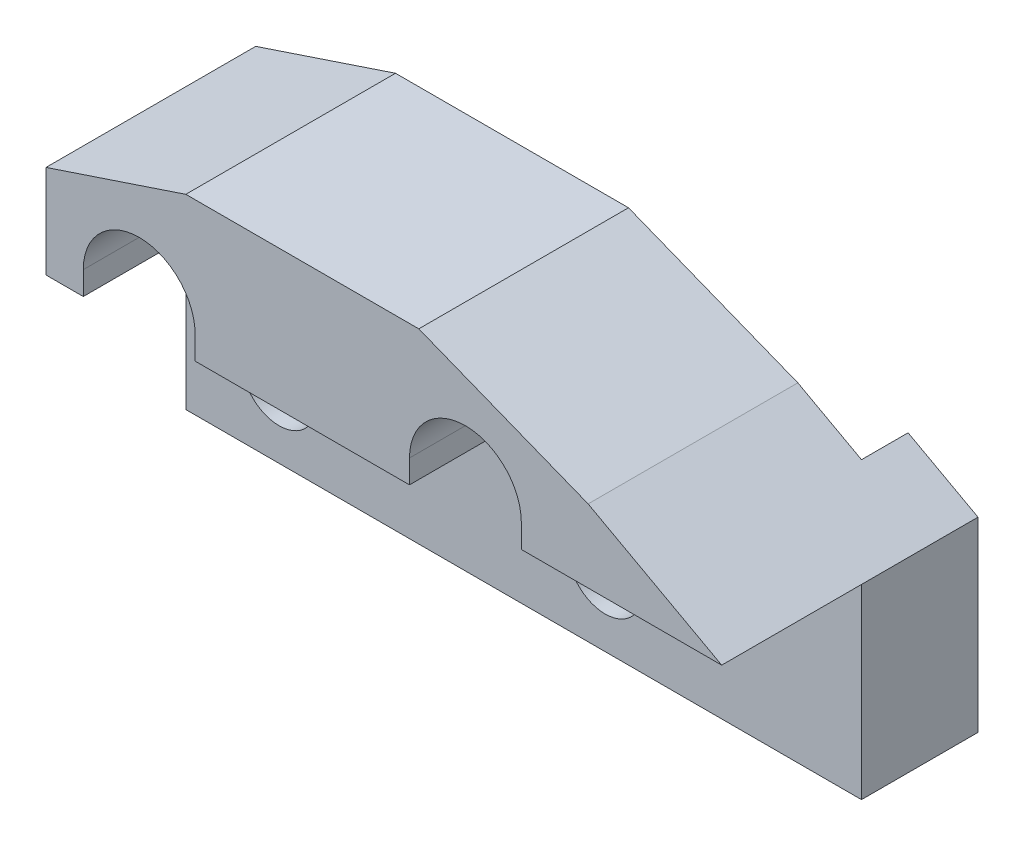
ISO-10303-21;
HEADER;
FILE_DESCRIPTION(('STEP AP214'),'2;1');
FILE_NAME('part.step','',(''),(''),'','','');
FILE_SCHEMA(('AUTOMOTIVE_DESIGN { 1 0 10303 214 1 1 1 1 }'));
ENDSEC;
DATA;
#1=APPLICATION_CONTEXT('core data for automotive mechanical design processes');
#2=APPLICATION_PROTOCOL_DEFINITION('international standard','automotive_design',2000,#1);
#3=PRODUCT_CONTEXT('',#1,'mechanical');
#4=PRODUCT('Part','Part','',(#3));
#5=PRODUCT_RELATED_PRODUCT_CATEGORY('part','',(#4));
#6=PRODUCT_DEFINITION_FORMATION('','',#4);
#7=PRODUCT_DEFINITION_CONTEXT('part definition',#1,'design');
#8=PRODUCT_DEFINITION('design','',#6,#7);
#9=PRODUCT_DEFINITION_SHAPE('','',#8);
#10=(LENGTH_UNIT() NAMED_UNIT(*) SI_UNIT(.MILLI.,.METRE.));
#11=(NAMED_UNIT(*) PLANE_ANGLE_UNIT() SI_UNIT($,.RADIAN.));
#12=(NAMED_UNIT(*) SI_UNIT($,.STERADIAN.) SOLID_ANGLE_UNIT());
#13=UNCERTAINTY_MEASURE_WITH_UNIT(LENGTH_MEASURE(1.E-05),#10,'distance_accuracy_value','');
#14=(GEOMETRIC_REPRESENTATION_CONTEXT(3) GLOBAL_UNCERTAINTY_ASSIGNED_CONTEXT((#13)) GLOBAL_UNIT_ASSIGNED_CONTEXT((#10,
#11,#12)) REPRESENTATION_CONTEXT('',''));
#15=CARTESIAN_POINT('',(0.,0.,0.));
#16=DIRECTION('',(0.,0.,1.));
#17=DIRECTION('',(1.,0.,0.));
#18=AXIS2_PLACEMENT_3D('',#15,#16,#17);
#19=CARTESIAN_POINT('',(107.732096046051,-10.039789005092,45.));
#20=DIRECTION('',(0.,1.,0.));
#21=DIRECTION('',(0.,0.,1.));
#22=AXIS2_PLACEMENT_3D('',#19,#20,#21);
#23=PLANE('',#22);
#24=DIRECTION('',(1.,0.,0.));
#25=VECTOR('',#24,1.);
#26=CARTESIAN_POINT('',(35.2320960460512,-10.039789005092,45.));
#27=LINE('',#26,#25);
#28=CARTESIAN_POINT('',(-5.26790395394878,-10.039789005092,45.));
#29=VERTEX_POINT('',#28);
#30=CARTESIAN_POINT('',(40.7320960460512,-10.039789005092,45.));
#31=VERTEX_POINT('',#30);
#32=EDGE_CURVE('E160',#29,#31,#27,.T.);
#33=ORIENTED_EDGE('',*,*,#32,.F.);
#34=DIRECTION('',(0.,0.,-1.));
#35=VECTOR('',#34,1.);
#36=CARTESIAN_POINT('',(-5.26790395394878,-10.039789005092,15.));
#37=LINE('',#36,#35);
#38=CARTESIAN_POINT('',(-5.26790395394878,-10.039789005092,15.));
#39=VERTEX_POINT('',#38);
#40=EDGE_CURVE('E159',#29,#39,#37,.T.);
#41=ORIENTED_EDGE('',*,*,#40,.T.);
#42=DIRECTION('',(1.,0.,0.));
#43=VECTOR('',#42,1.);
#44=CARTESIAN_POINT('',(35.2320960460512,-10.039789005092,15.));
#45=LINE('',#44,#43);
#46=CARTESIAN_POINT('',(40.7320960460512,-10.039789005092,15.));
#47=VERTEX_POINT('',#46);
#48=EDGE_CURVE('E145',#47,#39,#45,.F.);
#49=ORIENTED_EDGE('',*,*,#48,.F.);
#50=DIRECTION('',(0.,0.,1.));
#51=VECTOR('',#50,1.);
#52=CARTESIAN_POINT('',(40.7320960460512,-10.039789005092,15.));
#53=LINE('',#52,#51);
#54=EDGE_CURVE('E309',#47,#31,#53,.T.);
#55=ORIENTED_EDGE('',*,*,#54,.T.);
#56=EDGE_LOOP('',(#33,#41,#49,#55));
#57=FACE_BOUND('',#56,.T.);
#58=ADVANCED_FACE('F16',(#57),#23,.F.);
#59=CARTESIAN_POINT('',(-5.26790395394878,-5.03978900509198,15.));
#60=DIRECTION('',(1.,0.,0.));
#61=DIRECTION('',(0.,0.,-1.));
#62=AXIS2_PLACEMENT_3D('',#59,#60,#61);
#63=PLANE('',#62);
#64=DIRECTION('',(0.,1.,0.));
#65=VECTOR('',#64,1.);
#66=CARTESIAN_POINT('',(-5.26790395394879,-15.039789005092,45.));
#67=LINE('',#66,#65);
#68=CARTESIAN_POINT('',(-5.26790395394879,-5.03978900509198,45.));
#69=VERTEX_POINT('',#68);
#70=EDGE_CURVE('E366',#69,#29,#67,.F.);
#71=ORIENTED_EDGE('',*,*,#70,.F.);
#72=DIRECTION('',(0.,0.,1.));
#73=VECTOR('',#72,1.);
#74=CARTESIAN_POINT('',(-5.26790395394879,-5.03978900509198,15.));
#75=LINE('',#74,#73);
#76=CARTESIAN_POINT('',(-5.26790395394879,-5.03978900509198,15.));
#77=VERTEX_POINT('',#76);
#78=EDGE_CURVE('E164',#69,#77,#75,.F.);
#79=ORIENTED_EDGE('',*,*,#78,.T.);
#80=DIRECTION('',(0.,1.,0.));
#81=VECTOR('',#80,1.);
#82=CARTESIAN_POINT('',(-5.26790395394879,-30.039789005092,15.));
#83=LINE('',#82,#81);
#84=EDGE_CURVE('E149',#39,#77,#83,.T.);
#85=ORIENTED_EDGE('',*,*,#84,.F.);
#86=ORIENTED_EDGE('',*,*,#40,.F.);
#87=EDGE_LOOP('',(#71,#79,#85,#86));
#88=FACE_BOUND('',#87,.T.);
#89=ADVANCED_FACE('F166',(#88),#63,.F.);
#90=CARTESIAN_POINT('',(-17.2679039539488,-5.03978900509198,15.));
#91=DIRECTION('',(0.,0.,1.));
#92=DIRECTION('',(1.,0.,0.));
#93=AXIS2_PLACEMENT_3D('',#90,#91,#92);
#94=CYLINDRICAL_SURFACE('',#93,12.);
#95=DIRECTION('',(0.,0.,1.));
#96=VECTOR('',#95,1.);
#97=CARTESIAN_POINT('',(-29.2679039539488,-5.03978900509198,15.));
#98=LINE('',#97,#96);
#99=CARTESIAN_POINT('',(-29.2679039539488,-5.03978900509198,45.));
#100=VERTEX_POINT('',#99);
#101=CARTESIAN_POINT('',(-29.2679039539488,-5.03978900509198,15.));
#102=VERTEX_POINT('',#101);
#103=EDGE_CURVE('E119',#100,#102,#98,.F.);
#104=ORIENTED_EDGE('',*,*,#103,.T.);
#105=CARTESIAN_POINT('',(-17.2679039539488,-5.03978900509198,15.));
#106=DIRECTION('',(0.,0.,1.));
#107=DIRECTION('',(1.,0.,0.));
#108=AXIS2_PLACEMENT_3D('',#105,#106,#107);
#109=CIRCLE('',#108,12.);
#110=EDGE_CURVE('E168',#77,#102,#109,.T.);
#111=ORIENTED_EDGE('',*,*,#110,.F.);
#112=ORIENTED_EDGE('',*,*,#78,.F.);
#113=CARTESIAN_POINT('',(-17.2679039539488,-5.03978900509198,45.));
#114=DIRECTION('',(0.,0.,1.));
#115=DIRECTION('',(1.,0.,0.));
#116=AXIS2_PLACEMENT_3D('',#113,#114,#115);
#117=CIRCLE('',#116,12.);
#118=EDGE_CURVE('E401',#100,#69,#117,.F.);
#119=ORIENTED_EDGE('',*,*,#118,.F.);
#120=EDGE_LOOP('',(#104,#111,#112,#119));
#121=FACE_BOUND('',#120,.T.);
#122=ADVANCED_FACE('F538',(#121),#94,.F.);
#123=CARTESIAN_POINT('',(-29.2679039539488,-19.6457828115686,15.));
#124=DIRECTION('',(-1.,0.,0.));
#125=DIRECTION('',(0.,0.,1.));
#126=AXIS2_PLACEMENT_3D('',#123,#124,#125);
#127=PLANE('',#126);
#128=DIRECTION('',(0.,1.,0.));
#129=VECTOR('',#128,1.);
#130=CARTESIAN_POINT('',(-29.2679039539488,-30.039789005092,15.));
#131=LINE('',#130,#129);
#132=CARTESIAN_POINT('',(-29.2679039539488,-10.039789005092,15.));
#133=VERTEX_POINT('',#132);
#134=EDGE_CURVE('E170',#102,#133,#131,.F.);
#135=ORIENTED_EDGE('',*,*,#134,.F.);
#136=ORIENTED_EDGE('',*,*,#103,.F.);
#137=DIRECTION('',(0.,1.,0.));
#138=VECTOR('',#137,1.);
#139=CARTESIAN_POINT('',(-29.2679039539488,-15.039789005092,45.));
#140=LINE('',#139,#138);
#141=CARTESIAN_POINT('',(-29.2679039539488,-10.039789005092,45.));
#142=VERTEX_POINT('',#141);
#143=EDGE_CURVE('E371',#142,#100,#140,.T.);
#144=ORIENTED_EDGE('',*,*,#143,.F.);
#145=DIRECTION('',(0.,0.,1.));
#146=VECTOR('',#145,1.);
#147=CARTESIAN_POINT('',(-29.2679039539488,-10.039789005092,45.));
#148=LINE('',#147,#146);
#149=EDGE_CURVE('E128',#142,#133,#148,.F.);
#150=ORIENTED_EDGE('',*,*,#149,.T.);
#151=EDGE_LOOP('',(#135,#136,#144,#150));
#152=FACE_BOUND('',#151,.T.);
#153=ADVANCED_FACE('F533',(#152),#127,.F.);
#154=CARTESIAN_POINT('',(64.7320960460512,-5.03978900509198,15.));
#155=DIRECTION('',(1.,0.,0.));
#156=DIRECTION('',(0.,0.,-1.));
#157=AXIS2_PLACEMENT_3D('',#154,#155,#156);
#158=PLANE('',#157);
#159=DIRECTION('',(0.,1.,0.));
#160=VECTOR('',#159,1.);
#161=CARTESIAN_POINT('',(64.7320960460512,-15.039789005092,45.));
#162=LINE('',#161,#160);
#163=CARTESIAN_POINT('',(64.7320960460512,-5.03978900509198,45.));
#164=VERTEX_POINT('',#163);
#165=CARTESIAN_POINT('',(64.7320960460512,-10.039789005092,45.));
#166=VERTEX_POINT('',#165);
#167=EDGE_CURVE('E354',#164,#166,#162,.F.);
#168=ORIENTED_EDGE('',*,*,#167,.F.);
#169=DIRECTION('',(0.,0.,1.));
#170=VECTOR('',#169,1.);
#171=CARTESIAN_POINT('',(64.7320960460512,-5.03978900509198,15.));
#172=LINE('',#171,#170);
#173=CARTESIAN_POINT('',(64.7320960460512,-5.03978900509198,15.));
#174=VERTEX_POINT('',#173);
#175=EDGE_CURVE('E310',#164,#174,#172,.F.);
#176=ORIENTED_EDGE('',*,*,#175,.T.);
#177=DIRECTION('',(0.,1.,0.));
#178=VECTOR('',#177,1.);
#179=CARTESIAN_POINT('',(64.7320960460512,-30.039789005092,15.));
#180=LINE('',#179,#178);
#181=CARTESIAN_POINT('',(64.7320960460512,-10.039789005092,15.));
#182=VERTEX_POINT('',#181);
#183=EDGE_CURVE('E322',#182,#174,#180,.T.);
#184=ORIENTED_EDGE('',*,*,#183,.F.);
#185=DIRECTION('',(0.,0.,1.));
#186=VECTOR('',#185,1.);
#187=CARTESIAN_POINT('',(64.7320960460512,-10.039789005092,45.));
#188=LINE('',#187,#186);
#189=EDGE_CURVE('E312',#182,#166,#188,.T.);
#190=ORIENTED_EDGE('',*,*,#189,.T.);
#191=EDGE_LOOP('',(#168,#176,#184,#190));
#192=FACE_BOUND('',#191,.T.);
#193=ADVANCED_FACE('F528',(#192),#158,.F.);
#194=CARTESIAN_POINT('',(52.7320960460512,-5.03978900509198,15.));
#195=DIRECTION('',(0.,0.,1.));
#196=DIRECTION('',(1.,0.,0.));
#197=AXIS2_PLACEMENT_3D('',#194,#195,#196);
#198=CYLINDRICAL_SURFACE('',#197,12.);
#199=DIRECTION('',(0.,0.,1.));
#200=VECTOR('',#199,1.);
#201=CARTESIAN_POINT('',(40.7320960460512,-5.03978900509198,15.));
#202=LINE('',#201,#200);
#203=CARTESIAN_POINT('',(40.7320960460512,-5.03978900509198,45.));
#204=VERTEX_POINT('',#203);
#205=CARTESIAN_POINT('',(40.7320960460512,-5.03978900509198,15.));
#206=VERTEX_POINT('',#205);
#207=EDGE_CURVE('E306',#204,#206,#202,.F.);
#208=ORIENTED_EDGE('',*,*,#207,.T.);
#209=CARTESIAN_POINT('',(52.7320960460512,-5.03978900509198,15.));
#210=DIRECTION('',(0.,0.,1.));
#211=DIRECTION('',(1.,0.,0.));
#212=AXIS2_PLACEMENT_3D('',#209,#210,#211);
#213=CIRCLE('',#212,12.);
#214=EDGE_CURVE('E396',#174,#206,#213,.T.);
#215=ORIENTED_EDGE('',*,*,#214,.F.);
#216=ORIENTED_EDGE('',*,*,#175,.F.);
#217=CARTESIAN_POINT('',(52.7320960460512,-5.03978900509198,45.));
#218=DIRECTION('',(0.,0.,1.));
#219=DIRECTION('',(1.,0.,0.));
#220=AXIS2_PLACEMENT_3D('',#217,#218,#219);
#221=CIRCLE('',#220,12.);
#222=EDGE_CURVE('E398',#204,#164,#221,.F.);
#223=ORIENTED_EDGE('',*,*,#222,.F.);
#224=EDGE_LOOP('',(#208,#215,#216,#223));
#225=FACE_BOUND('',#224,.T.);
#226=ADVANCED_FACE('F523',(#225),#198,.F.);
#227=CARTESIAN_POINT('',(40.7320960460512,-19.4306242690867,15.));
#228=DIRECTION('',(-1.,0.,0.));
#229=DIRECTION('',(0.,0.,1.));
#230=AXIS2_PLACEMENT_3D('',#227,#228,#229);
#231=PLANE('',#230);
#232=DIRECTION('',(0.,1.,0.));
#233=VECTOR('',#232,1.);
#234=CARTESIAN_POINT('',(40.7320960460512,-30.039789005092,15.));
#235=LINE('',#234,#233);
#236=EDGE_CURVE('E152',#206,#47,#235,.F.);
#237=ORIENTED_EDGE('',*,*,#236,.F.);
#238=ORIENTED_EDGE('',*,*,#207,.F.);
#239=DIRECTION('',(0.,1.,0.));
#240=VECTOR('',#239,1.);
#241=CARTESIAN_POINT('',(40.7320960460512,-15.039789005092,45.));
#242=LINE('',#241,#240);
#243=EDGE_CURVE('E365',#31,#204,#242,.T.);
#244=ORIENTED_EDGE('',*,*,#243,.F.);
#245=ORIENTED_EDGE('',*,*,#54,.F.);
#246=EDGE_LOOP('',(#237,#238,#244,#245));
#247=FACE_BOUND('',#246,.T.);
#248=ADVANCED_FACE('F518',(#247),#231,.F.);
#249=CARTESIAN_POINT('',(107.732096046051,-10.039789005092,45.));
#250=DIRECTION('',(0.,1.,0.));
#251=DIRECTION('',(0.,0.,1.));
#252=AXIS2_PLACEMENT_3D('',#249,#250,#251);
#253=PLANE('',#252);
#254=DIRECTION('',(1.,0.,0.));
#255=VECTOR('',#254,1.);
#256=CARTESIAN_POINT('',(35.2320960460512,-10.039789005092,15.));
#257=LINE('',#256,#255);
#258=CARTESIAN_POINT('',(107.732096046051,-10.039789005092,15.));
#259=VERTEX_POINT('',#258);
#260=EDGE_CURVE('E319',#259,#182,#257,.F.);
#261=ORIENTED_EDGE('',*,*,#260,.F.);
#262=DIRECTION('',(0.,0.,1.));
#263=VECTOR('',#262,1.);
#264=CARTESIAN_POINT('',(107.732096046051,-10.039789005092,0.));
#265=LINE('',#264,#263);
#266=CARTESIAN_POINT('',(107.732096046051,-10.039789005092,45.));
#267=VERTEX_POINT('',#266);
#268=EDGE_CURVE('E186',#267,#259,#265,.F.);
#269=ORIENTED_EDGE('',*,*,#268,.F.);
#270=DIRECTION('',(1.,0.,0.));
#271=VECTOR('',#270,1.);
#272=CARTESIAN_POINT('',(35.2320960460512,-10.039789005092,45.));
#273=LINE('',#272,#271);
#274=EDGE_CURVE('E372',#166,#267,#273,.T.);
#275=ORIENTED_EDGE('',*,*,#274,.F.);
#276=ORIENTED_EDGE('',*,*,#189,.F.);
#277=EDGE_LOOP('',(#261,#269,#275,#276));
#278=FACE_BOUND('',#277,.T.);
#279=ADVANCED_FACE('F514',(#278),#253,.F.);
#280=CARTESIAN_POINT('',(107.732096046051,-10.039789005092,45.));
#281=DIRECTION('',(0.,1.,0.));
#282=DIRECTION('',(0.,0.,1.));
#283=AXIS2_PLACEMENT_3D('',#280,#281,#282);
#284=PLANE('',#283);
#285=DIRECTION('',(1.,0.,0.));
#286=VECTOR('',#285,1.);
#287=CARTESIAN_POINT('',(35.2320960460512,-10.039789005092,45.));
#288=LINE('',#287,#286);
#289=CARTESIAN_POINT('',(-37.2679039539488,-10.039789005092,45.));
#290=VERTEX_POINT('',#289);
#291=EDGE_CURVE('E369',#290,#142,#288,.T.);
#292=ORIENTED_EDGE('',*,*,#291,.F.);
#293=DIRECTION('',(0.,0.,1.));
#294=VECTOR('',#293,1.);
#295=CARTESIAN_POINT('',(-37.2679039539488,-10.039789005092,0.));
#296=LINE('',#295,#294);
#297=CARTESIAN_POINT('',(-37.2679039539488,-10.039789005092,15.));
#298=VERTEX_POINT('',#297);
#299=EDGE_CURVE('E209',#298,#290,#296,.T.);
#300=ORIENTED_EDGE('',*,*,#299,.F.);
#301=DIRECTION('',(1.,0.,0.));
#302=VECTOR('',#301,1.);
#303=CARTESIAN_POINT('',(35.2320960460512,-10.039789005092,15.));
#304=LINE('',#303,#302);
#305=EDGE_CURVE('E340',#133,#298,#304,.F.);
#306=ORIENTED_EDGE('',*,*,#305,.F.);
#307=ORIENTED_EDGE('',*,*,#149,.F.);
#308=EDGE_LOOP('',(#292,#300,#306,#307));
#309=FACE_BOUND('',#308,.T.);
#310=ADVANCED_FACE('F509',(#309),#284,.F.);
#311=CARTESIAN_POINT('',(35.2320960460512,-15.039789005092,45.));
#312=DIRECTION('',(0.,0.,1.));
#313=DIRECTION('',(1.,0.,0.));
#314=AXIS2_PLACEMENT_3D('',#311,#312,#313);
#315=PLANE('',#314);
#316=ORIENTED_EDGE('',*,*,#243,.T.);
#317=ORIENTED_EDGE('',*,*,#222,.T.);
#318=ORIENTED_EDGE('',*,*,#167,.T.);
#319=ORIENTED_EDGE('',*,*,#274,.T.);
#320=DIRECTION('',(-0.877895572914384,0.478852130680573,0.));
#321=VECTOR('',#320,1.);
#322=CARTESIAN_POINT('',(80.2320960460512,4.96021099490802,45.));
#323=LINE('',#322,#321);
#324=CARTESIAN_POINT('',(79.0689632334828,5.59464707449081,45.));
#325=VERTEX_POINT('',#324);
#326=EDGE_CURVE('E183',#325,#267,#323,.F.);
#327=ORIENTED_EDGE('',*,*,#326,.F.);
#328=DIRECTION('',(-0.92996224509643,0.367655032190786,0.));
#329=VECTOR('',#328,1.);
#330=CARTESIAN_POINT('',(60.900529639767,12.7774290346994,45.));
#331=LINE('',#330,#329);
#332=CARTESIAN_POINT('',(42.7320960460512,19.960210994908,45.));
#333=VERTEX_POINT('',#332);
#334=EDGE_CURVE('E181',#333,#325,#331,.F.);
#335=ORIENTED_EDGE('',*,*,#334,.F.);
#336=DIRECTION('',(1.,0.,0.));
#337=VECTOR('',#336,1.);
#338=CARTESIAN_POINT('',(-37.2679039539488,19.960210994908,45.));
#339=LINE('',#338,#337);
#340=CARTESIAN_POINT('',(-7.26790395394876,19.960210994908,45.));
#341=VERTEX_POINT('',#340);
#342=EDGE_CURVE('E194',#341,#333,#339,.T.);
#343=ORIENTED_EDGE('',*,*,#342,.F.);
#344=DIRECTION('',(-0.948683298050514,-0.316227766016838,0.));
#345=VECTOR('',#344,1.);
#346=CARTESIAN_POINT('',(-22.2679039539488,14.960210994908,45.));
#347=LINE('',#346,#345);
#348=CARTESIAN_POINT('',(-37.2679039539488,9.96021099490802,45.));
#349=VERTEX_POINT('',#348);
#350=EDGE_CURVE('E197',#349,#341,#347,.F.);
#351=ORIENTED_EDGE('',*,*,#350,.F.);
#352=DIRECTION('',(0.,1.,0.));
#353=VECTOR('',#352,1.);
#354=CARTESIAN_POINT('',(-37.2679039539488,-50.039789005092,45.));
#355=LINE('',#354,#353);
#356=EDGE_CURVE('E349',#290,#349,#355,.T.);
#357=ORIENTED_EDGE('',*,*,#356,.F.);
#358=ORIENTED_EDGE('',*,*,#291,.T.);
#359=ORIENTED_EDGE('',*,*,#143,.T.);
#360=ORIENTED_EDGE('',*,*,#118,.T.);
#361=ORIENTED_EDGE('',*,*,#70,.T.);
#362=ORIENTED_EDGE('',*,*,#32,.T.);
#363=EDGE_LOOP('',(#316,#317,#318,#319,#327,#335,#343,#351,#357,#358,#359,#360,#361,#362));
#364=FACE_BOUND('',#363,.T.);
#365=ADVANCED_FACE('F504',(#364),#315,.T.);
#366=CARTESIAN_POINT('',(107.732096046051,19.960210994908,0.));
#367=DIRECTION('',(1.,0.,0.));
#368=DIRECTION('',(0.,0.,-1.));
#369=AXIS2_PLACEMENT_3D('',#366,#367,#368);
#370=PLANE('',#369);
#371=DIRECTION('',(0.,0.,-1.));
#372=VECTOR('',#371,1.);
#373=CARTESIAN_POINT('',(107.732096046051,-50.039789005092,0.));
#374=LINE('',#373,#372);
#375=CARTESIAN_POINT('',(107.732096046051,-50.039789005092,-10.));
#376=VERTEX_POINT('',#375);
#377=CARTESIAN_POINT('',(107.732096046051,-50.039789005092,15.));
#378=VERTEX_POINT('',#377);
#379=EDGE_CURVE('E215',#376,#378,#374,.F.);
#380=ORIENTED_EDGE('',*,*,#379,.F.);
#381=DIRECTION('',(0.,1.,0.));
#382=VECTOR('',#381,1.);
#383=CARTESIAN_POINT('',(107.732096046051,-27.4727557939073,-10.));
#384=LINE('',#383,#382);
#385=CARTESIAN_POINT('',(107.732096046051,-10.039789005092,-10.));
#386=VERTEX_POINT('',#385);
#387=EDGE_CURVE('E155',#376,#386,#384,.T.);
#388=ORIENTED_EDGE('',*,*,#387,.T.);
#389=DIRECTION('',(0.,0.,1.));
#390=VECTOR('',#389,1.);
#391=CARTESIAN_POINT('',(107.732096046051,-10.039789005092,0.));
#392=LINE('',#391,#390);
#393=EDGE_CURVE('E182',#259,#386,#392,.F.);
#394=ORIENTED_EDGE('',*,*,#393,.F.);
#395=DIRECTION('',(0.,1.,0.));
#396=VECTOR('',#395,1.);
#397=CARTESIAN_POINT('',(107.732096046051,-30.039789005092,15.));
#398=LINE('',#397,#396);
#399=EDGE_CURVE('E323',#378,#259,#398,.T.);
#400=ORIENTED_EDGE('',*,*,#399,.F.);
#401=EDGE_LOOP('',(#380,#388,#394,#400));
#402=FACE_BOUND('',#401,.T.);
#403=ADVANCED_FACE('F499',(#402),#370,.T.);
#404=CARTESIAN_POINT('',(99.7218724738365,-27.4727557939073,-10.));
#405=DIRECTION('',(0.,0.,1.));
#406=DIRECTION('',(1.,0.,0.));
#407=AXIS2_PLACEMENT_3D('',#404,#405,#406);
#408=PLANE('',#407);
#409=ORIENTED_EDGE('',*,*,#387,.F.);
#410=DIRECTION('',(1.,0.,0.));
#411=VECTOR('',#410,1.);
#412=CARTESIAN_POINT('',(107.732096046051,-50.039789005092,-10.));
#413=LINE('',#412,#411);
#414=CARTESIAN_POINT('',(92.7320960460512,-50.039789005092,-10.));
#415=VERTEX_POINT('',#414);
#416=EDGE_CURVE('E212',#415,#376,#413,.T.);
#417=ORIENTED_EDGE('',*,*,#416,.F.);
#418=DIRECTION('',(0.,1.,0.));
#419=VECTOR('',#418,1.);
#420=CARTESIAN_POINT('',(92.7320960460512,-1.8579708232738,-10.));
#421=LINE('',#420,#419);
#422=CARTESIAN_POINT('',(92.7320960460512,-1.8579708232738,-10.));
#423=VERTEX_POINT('',#422);
#424=EDGE_CURVE('E227',#423,#415,#421,.F.);
#425=ORIENTED_EDGE('',*,*,#424,.F.);
#426=DIRECTION('',(-0.877895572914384,0.478852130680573,0.));
#427=VECTOR('',#426,1.);
#428=CARTESIAN_POINT('',(80.2320960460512,4.96021099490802,-10.));
#429=LINE('',#428,#427);
#430=EDGE_CURVE('E178',#386,#423,#429,.T.);
#431=ORIENTED_EDGE('',*,*,#430,.F.);
#432=EDGE_LOOP('',(#409,#417,#425,#431));
#433=FACE_BOUND('',#432,.T.);
#434=ADVANCED_FACE('F495',(#433),#408,.F.);
#435=CARTESIAN_POINT('',(35.2320960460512,-30.039789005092,15.));
#436=DIRECTION('',(0.,0.,1.));
#437=DIRECTION('',(1.,0.,0.));
#438=AXIS2_PLACEMENT_3D('',#435,#436,#437);
#439=PLANE('',#438);
#440=DIRECTION('',(-0.000598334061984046,-0.999999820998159,0.));
#441=VECTOR('',#440,1.);
#442=CARTESIAN_POINT('',(-9.2679057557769,-35.0344197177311,15.));
#443=LINE('',#442,#441);
#444=CARTESIAN_POINT('',(-9.26790575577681,-35.0344197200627,15.));
#445=VERTEX_POINT('',#444);
#446=CARTESIAN_POINT('',(-9.26791790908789,-35.0547316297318,15.));
#447=VERTEX_POINT('',#446);
#448=EDGE_CURVE('E187',#445,#447,#443,.T.);
#449=ORIENTED_EDGE('',*,*,#448,.T.);
#450=CARTESIAN_POINT('',(-17.2679039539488,-35.039789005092,15.));
#451=DIRECTION('',(0.,0.,-1.));
#452=DIRECTION('',(-1.,0.,0.));
#453=AXIS2_PLACEMENT_3D('',#450,#451,#452);
#454=CIRCLE('',#453,8.);
#455=CARTESIAN_POINT('',(-25.2678899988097,-35.0248463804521,15.));
#456=VERTEX_POINT('',#455);
#457=EDGE_CURVE('E268',#447,#456,#454,.T.);
#458=ORIENTED_EDGE('',*,*,#457,.T.);
#459=DIRECTION('',(-0.001867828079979,-0.99999825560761,0.));
#460=VECTOR('',#459,1.);
#461=CARTESIAN_POINT('',(-25.2136207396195,-5.97015708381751,15.));
#462=LINE('',#461,#460);
#463=CARTESIAN_POINT('',(-25.2136207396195,-5.97015708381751,15.));
#464=VERTEX_POINT('',#463);
#465=EDGE_CURVE('E267',#456,#464,#462,.F.);
#466=ORIENTED_EDGE('',*,*,#465,.T.);
#467=CARTESIAN_POINT('',(-17.2679039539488,-5.03978900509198,15.));
#468=DIRECTION('',(0.,0.,-1.));
#469=DIRECTION('',(-1.,0.,0.));
#470=AXIS2_PLACEMENT_3D('',#467,#468,#469);
#471=CIRCLE('',#470,8.);
#472=CARTESIAN_POINT('',(-9.28765987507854,-5.60166482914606,15.));
#473=VERTEX_POINT('',#472);
#474=EDGE_CURVE('E275',#464,#473,#471,.T.);
#475=ORIENTED_EDGE('',*,*,#474,.T.);
#476=DIRECTION('',(-0.000671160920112,0.999999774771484,0.));
#477=VECTOR('',#476,1.);
#478=CARTESIAN_POINT('',(-9.2679057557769,-35.0344197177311,15.));
#479=LINE('',#478,#477);
#480=EDGE_CURVE('E274',#473,#445,#479,.F.);
#481=ORIENTED_EDGE('',*,*,#480,.T.);
#482=EDGE_LOOP('',(#449,#458,#466,#475,#481));
#483=FACE_BOUND('',#482,.T.);
#484=DIRECTION('',(-0.005146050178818,0.999986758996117,0.));
#485=VECTOR('',#484,1.);
#486=CARTESIAN_POINT('',(60.7319901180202,-34.9986206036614,15.));
#487=LINE('',#486,#485);
#488=CARTESIAN_POINT('',(60.5856593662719,-6.56345011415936,15.));
#489=VERTEX_POINT('',#488);
#490=CARTESIAN_POINT('',(60.7319901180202,-34.9986206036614,15.));
#491=VERTEX_POINT('',#490);
#492=EDGE_CURVE('E292',#489,#491,#487,.F.);
#493=ORIENTED_EDGE('',*,*,#492,.T.);
#494=CARTESIAN_POINT('',(52.7320960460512,-35.039789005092,15.));
#495=DIRECTION('',(0.,0.,-1.));
#496=DIRECTION('',(-1.,0.,0.));
#497=AXIS2_PLACEMENT_3D('',#494,#495,#496);
#498=CIRCLE('',#497,8.);
#499=CARTESIAN_POINT('',(44.7690412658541,-35.8077464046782,15.));
#500=VERTEX_POINT('',#499);
#501=EDGE_CURVE('E285',#491,#500,#498,.T.);
#502=ORIENTED_EDGE('',*,*,#501,.T.);
#503=DIRECTION('',(0.000671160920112,-0.999999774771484,0.));
#504=VECTOR('',#503,1.);
#505=CARTESIAN_POINT('',(44.7680175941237,-34.2825212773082,15.));
#506=LINE('',#505,#504);
#507=CARTESIAN_POINT('',(44.7487371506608,-5.55552221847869,15.));
#508=VERTEX_POINT('',#507);
#509=EDGE_CURVE('E284',#500,#508,#506,.F.);
#510=ORIENTED_EDGE('',*,*,#509,.T.);
#511=CARTESIAN_POINT('',(52.7320960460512,-5.03978900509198,15.));
#512=DIRECTION('',(0.,0.,-1.));
#513=DIRECTION('',(-1.,0.,0.));
#514=AXIS2_PLACEMENT_3D('',#511,#512,#513);
#515=CIRCLE('',#514,8.);
#516=EDGE_CURVE('E223',#508,#489,#515,.T.);
#517=ORIENTED_EDGE('',*,*,#516,.T.);
#518=EDGE_LOOP('',(#493,#502,#510,#517));
#519=FACE_BOUND('',#518,.T.);
#520=ORIENTED_EDGE('',*,*,#214,.T.);
#521=ORIENTED_EDGE('',*,*,#236,.T.);
#522=ORIENTED_EDGE('',*,*,#48,.T.);
#523=ORIENTED_EDGE('',*,*,#84,.T.);
#524=ORIENTED_EDGE('',*,*,#110,.T.);
#525=ORIENTED_EDGE('',*,*,#134,.T.);
#526=ORIENTED_EDGE('',*,*,#305,.T.);
#527=DIRECTION('',(0.,1.,0.));
#528=VECTOR('',#527,1.);
#529=CARTESIAN_POINT('',(-37.2679039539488,-50.039789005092,15.));
#530=LINE('',#529,#528);
#531=CARTESIAN_POINT('',(-37.2679039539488,-50.039789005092,15.));
#532=VERTEX_POINT('',#531);
#533=EDGE_CURVE('E206',#532,#298,#530,.T.);
#534=ORIENTED_EDGE('',*,*,#533,.F.);
#535=DIRECTION('',(1.,0.,0.));
#536=VECTOR('',#535,1.);
#537=CARTESIAN_POINT('',(107.732096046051,-50.039789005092,15.));
#538=LINE('',#537,#536);
#539=EDGE_CURVE('E219',#378,#532,#538,.F.);
#540=ORIENTED_EDGE('',*,*,#539,.F.);
#541=ORIENTED_EDGE('',*,*,#399,.T.);
#542=ORIENTED_EDGE('',*,*,#260,.T.);
#543=ORIENTED_EDGE('',*,*,#183,.T.);
#544=EDGE_LOOP('',(#520,#521,#522,#523,#524,#525,#526,#534,#540,#541,#542,#543));
#545=FACE_BOUND('',#544,.T.);
#546=ADVANCED_FACE('F147',(#483,#519,#545),#439,.T.);
#547=CARTESIAN_POINT('',(80.2320960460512,4.96021099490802,0.));
#548=DIRECTION('',(0.478852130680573,0.877895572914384,0.));
#549=DIRECTION('',(-0.877895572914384,0.478852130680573,0.));
#550=AXIS2_PLACEMENT_3D('',#547,#548,#549);
#551=PLANE('',#550);
#552=DIRECTION('',(0.,0.,1.));
#553=VECTOR('',#552,1.);
#554=CARTESIAN_POINT('',(92.7320960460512,-1.8579708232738,0.));
#555=LINE('',#554,#553);
#556=CARTESIAN_POINT('',(92.7320960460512,-1.8579708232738,0.));
#557=VERTEX_POINT('',#556);
#558=EDGE_CURVE('E220',#557,#423,#555,.F.);
#559=ORIENTED_EDGE('',*,*,#558,.F.);
#560=DIRECTION('',(-0.877895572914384,0.478852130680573,0.));
#561=VECTOR('',#560,1.);
#562=CARTESIAN_POINT('',(92.7320960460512,-1.8579708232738,0.));
#563=LINE('',#562,#561);
#564=CARTESIAN_POINT('',(79.0689632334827,5.59464707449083,0.));
#565=VERTEX_POINT('',#564);
#566=EDGE_CURVE('E262',#557,#565,#563,.T.);
#567=ORIENTED_EDGE('',*,*,#566,.T.);
#568=DIRECTION('',(0.,0.,1.));
#569=VECTOR('',#568,1.);
#570=CARTESIAN_POINT('',(79.0689632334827,5.59464707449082,0.));
#571=LINE('',#570,#569);
#572=EDGE_CURVE('E188',#325,#565,#571,.F.);
#573=ORIENTED_EDGE('',*,*,#572,.F.);
#574=ORIENTED_EDGE('',*,*,#326,.T.);
#575=ORIENTED_EDGE('',*,*,#268,.T.);
#576=ORIENTED_EDGE('',*,*,#393,.T.);
#577=ORIENTED_EDGE('',*,*,#430,.T.);
#578=EDGE_LOOP('',(#559,#567,#573,#574,#575,#576,#577));
#579=FACE_BOUND('',#578,.T.);
#580=ADVANCED_FACE('F486',(#579),#551,.T.);
#581=CARTESIAN_POINT('',(60.900529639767,12.7774290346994,0.));
#582=DIRECTION('',(0.367655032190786,0.92996224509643,0.));
#583=DIRECTION('',(-0.92996224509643,0.367655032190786,0.));
#584=AXIS2_PLACEMENT_3D('',#581,#582,#583);
#585=PLANE('',#584);
#586=DIRECTION('',(-0.92996224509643,0.367655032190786,0.));
#587=VECTOR('',#586,1.);
#588=CARTESIAN_POINT('',(79.0689632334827,5.59464707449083,0.));
#589=LINE('',#588,#587);
#590=CARTESIAN_POINT('',(42.7320960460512,19.960210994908,0.));
#591=VERTEX_POINT('',#590);
#592=EDGE_CURVE('E259',#565,#591,#589,.T.);
#593=ORIENTED_EDGE('',*,*,#592,.T.);
#594=DIRECTION('',(0.,0.,1.));
#595=VECTOR('',#594,1.);
#596=CARTESIAN_POINT('',(42.7320960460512,19.960210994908,0.));
#597=LINE('',#596,#595);
#598=EDGE_CURVE('E191',#333,#591,#597,.F.);
#599=ORIENTED_EDGE('',*,*,#598,.F.);
#600=ORIENTED_EDGE('',*,*,#334,.T.);
#601=ORIENTED_EDGE('',*,*,#572,.T.);
#602=EDGE_LOOP('',(#593,#599,#600,#601));
#603=FACE_BOUND('',#602,.T.);
#604=ADVANCED_FACE('F481',(#603),#585,.T.);
#605=CARTESIAN_POINT('',(-37.2679039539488,19.960210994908,0.));
#606=DIRECTION('',(0.,1.,0.));
#607=DIRECTION('',(0.,0.,1.));
#608=AXIS2_PLACEMENT_3D('',#605,#606,#607);
#609=PLANE('',#608);
#610=DIRECTION('',(0.,0.,1.));
#611=VECTOR('',#610,1.);
#612=CARTESIAN_POINT('',(-7.26790395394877,19.960210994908,0.));
#613=LINE('',#612,#611);
#614=CARTESIAN_POINT('',(-7.26790395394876,19.960210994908,0.));
#615=VERTEX_POINT('',#614);
#616=EDGE_CURVE('E200',#341,#615,#613,.F.);
#617=ORIENTED_EDGE('',*,*,#616,.F.);
#618=ORIENTED_EDGE('',*,*,#342,.T.);
#619=ORIENTED_EDGE('',*,*,#598,.T.);
#620=DIRECTION('',(1.,0.,0.));
#621=VECTOR('',#620,1.);
#622=CARTESIAN_POINT('',(35.2320960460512,19.960210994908,0.));
#623=LINE('',#622,#621);
#624=EDGE_CURVE('E256',#591,#615,#623,.F.);
#625=ORIENTED_EDGE('',*,*,#624,.T.);
#626=EDGE_LOOP('',(#617,#618,#619,#625));
#627=FACE_BOUND('',#626,.T.);
#628=ADVANCED_FACE('F476',(#627),#609,.T.);
#629=CARTESIAN_POINT('',(-22.2679039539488,14.960210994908,0.));
#630=DIRECTION('',(-0.316227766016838,0.948683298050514,0.));
#631=DIRECTION('',(-0.948683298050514,-0.316227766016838,0.));
#632=AXIS2_PLACEMENT_3D('',#629,#630,#631);
#633=PLANE('',#632);
#634=DIRECTION('',(-0.948683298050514,-0.316227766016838,0.));
#635=VECTOR('',#634,1.);
#636=CARTESIAN_POINT('',(-7.26790395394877,19.960210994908,0.));
#637=LINE('',#636,#635);
#638=CARTESIAN_POINT('',(-37.2679039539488,9.96021099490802,0.));
#639=VERTEX_POINT('',#638);
#640=EDGE_CURVE('E253',#615,#639,#637,.T.);
#641=ORIENTED_EDGE('',*,*,#640,.T.);
#642=DIRECTION('',(0.,0.,1.));
#643=VECTOR('',#642,1.);
#644=CARTESIAN_POINT('',(-37.2679039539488,9.96021099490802,0.));
#645=LINE('',#644,#643);
#646=EDGE_CURVE('E203',#349,#639,#645,.F.);
#647=ORIENTED_EDGE('',*,*,#646,.F.);
#648=ORIENTED_EDGE('',*,*,#350,.T.);
#649=ORIENTED_EDGE('',*,*,#616,.T.);
#650=EDGE_LOOP('',(#641,#647,#648,#649));
#651=FACE_BOUND('',#650,.T.);
#652=ADVANCED_FACE('F471',(#651),#633,.T.);
#653=CARTESIAN_POINT('',(-37.2679039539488,-50.039789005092,0.));
#654=DIRECTION('',(-1.,0.,0.));
#655=DIRECTION('',(0.,0.,1.));
#656=AXIS2_PLACEMENT_3D('',#653,#654,#655);
#657=PLANE('',#656);
#658=ORIENTED_EDGE('',*,*,#299,.T.);
#659=ORIENTED_EDGE('',*,*,#356,.T.);
#660=ORIENTED_EDGE('',*,*,#646,.T.);
#661=DIRECTION('',(0.,1.,0.));
#662=VECTOR('',#661,1.);
#663=CARTESIAN_POINT('',(-37.2679039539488,-15.039789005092,0.));
#664=LINE('',#663,#662);
#665=CARTESIAN_POINT('',(-37.2679039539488,-50.039789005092,0.));
#666=VERTEX_POINT('',#665);
#667=EDGE_CURVE('E250',#639,#666,#664,.F.);
#668=ORIENTED_EDGE('',*,*,#667,.T.);
#669=DIRECTION('',(0.,0.,-1.));
#670=VECTOR('',#669,1.);
#671=CARTESIAN_POINT('',(-37.2679039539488,-50.039789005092,0.));
#672=LINE('',#671,#670);
#673=EDGE_CURVE('E216',#532,#666,#672,.T.);
#674=ORIENTED_EDGE('',*,*,#673,.F.);
#675=ORIENTED_EDGE('',*,*,#533,.T.);
#676=EDGE_LOOP('',(#658,#659,#660,#668,#674,#675));
#677=FACE_BOUND('',#676,.T.);
#678=ADVANCED_FACE('F466',(#677),#657,.T.);
#679=CARTESIAN_POINT('',(107.732096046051,-50.039789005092,0.));
#680=DIRECTION('',(0.,-1.,0.));
#681=DIRECTION('',(0.,0.,-1.));
#682=AXIS2_PLACEMENT_3D('',#679,#680,#681);
#683=PLANE('',#682);
#684=ORIENTED_EDGE('',*,*,#416,.T.);
#685=ORIENTED_EDGE('',*,*,#379,.T.);
#686=ORIENTED_EDGE('',*,*,#539,.T.);
#687=ORIENTED_EDGE('',*,*,#673,.T.);
#688=DIRECTION('',(1.,0.,0.));
#689=VECTOR('',#688,1.);
#690=CARTESIAN_POINT('',(35.2320960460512,-50.039789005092,0.));
#691=LINE('',#690,#689);
#692=CARTESIAN_POINT('',(92.7320960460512,-50.039789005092,0.));
#693=VERTEX_POINT('',#692);
#694=EDGE_CURVE('E247',#666,#693,#691,.T.);
#695=ORIENTED_EDGE('',*,*,#694,.T.);
#696=DIRECTION('',(0.,0.,1.));
#697=VECTOR('',#696,1.);
#698=CARTESIAN_POINT('',(92.7320960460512,-50.039789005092,0.));
#699=LINE('',#698,#697);
#700=EDGE_CURVE('E224',#415,#693,#699,.T.);
#701=ORIENTED_EDGE('',*,*,#700,.F.);
#702=EDGE_LOOP('',(#684,#685,#686,#687,#695,#701));
#703=FACE_BOUND('',#702,.T.);
#704=ADVANCED_FACE('F461',(#703),#683,.T.);
#705=CARTESIAN_POINT('',(92.7320960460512,-1.8579708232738,0.));
#706=DIRECTION('',(-1.,0.,0.));
#707=DIRECTION('',(0.,0.,1.));
#708=AXIS2_PLACEMENT_3D('',#705,#706,#707);
#709=PLANE('',#708);
#710=DIRECTION('',(0.,1.,0.));
#711=VECTOR('',#710,1.);
#712=CARTESIAN_POINT('',(92.7320960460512,-15.039789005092,0.));
#713=LINE('',#712,#711);
#714=EDGE_CURVE('E244',#693,#557,#713,.T.);
#715=ORIENTED_EDGE('',*,*,#714,.T.);
#716=ORIENTED_EDGE('',*,*,#558,.T.);
#717=ORIENTED_EDGE('',*,*,#424,.T.);
#718=ORIENTED_EDGE('',*,*,#700,.T.);
#719=EDGE_LOOP('',(#715,#716,#717,#718));
#720=FACE_BOUND('',#719,.T.);
#721=ADVANCED_FACE('F456',(#720),#709,.T.);
#722=CARTESIAN_POINT('',(52.7320960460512,-5.03978900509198,15.));
#723=DIRECTION('',(0.,0.,-1.));
#724=DIRECTION('',(-1.,0.,0.));
#725=AXIS2_PLACEMENT_3D('',#722,#723,#724);
#726=CYLINDRICAL_SURFACE('',#725,8.);
#727=CARTESIAN_POINT('',(52.7320960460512,-5.03978900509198,0.));
#728=DIRECTION('',(0.,0.,-1.));
#729=DIRECTION('',(-1.,0.,0.));
#730=AXIS2_PLACEMENT_3D('',#727,#728,#729);
#731=CIRCLE('',#730,8.);
#732=CARTESIAN_POINT('',(44.7487371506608,-5.55552221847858,0.));
#733=VERTEX_POINT('',#732);
#734=CARTESIAN_POINT('',(60.5856593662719,-6.56345011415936,0.));
#735=VERTEX_POINT('',#734);
#736=EDGE_CURVE('E243',#733,#735,#731,.T.);
#737=ORIENTED_EDGE('',*,*,#736,.T.);
#738=DIRECTION('',(0.,0.,1.));
#739=VECTOR('',#738,1.);
#740=CARTESIAN_POINT('',(60.5856593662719,-6.56345011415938,15.));
#741=LINE('',#740,#739);
#742=EDGE_CURVE('E289',#735,#489,#741,.T.);
#743=ORIENTED_EDGE('',*,*,#742,.T.);
#744=ORIENTED_EDGE('',*,*,#516,.F.);
#745=DIRECTION('',(0.,0.,1.));
#746=VECTOR('',#745,1.);
#747=CARTESIAN_POINT('',(44.7487371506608,-5.55552221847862,15.));
#748=LINE('',#747,#746);
#749=EDGE_CURVE('E286',#508,#733,#748,.F.);
#750=ORIENTED_EDGE('',*,*,#749,.T.);
#751=EDGE_LOOP('',(#737,#743,#744,#750));
#752=FACE_BOUND('',#751,.T.);
#753=ADVANCED_FACE('F451',(#752),#726,.F.);
#754=CARTESIAN_POINT('',(60.7319901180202,-34.9986206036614,15.));
#755=DIRECTION('',(0.999986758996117,0.005146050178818,0.));
#756=DIRECTION('',(-0.005146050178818,0.999986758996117,0.));
#757=AXIS2_PLACEMENT_3D('',#754,#755,#756);
#758=PLANE('',#757);
#759=DIRECTION('',(0.,0.,1.));
#760=VECTOR('',#759,1.);
#761=CARTESIAN_POINT('',(60.7319901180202,-34.9986206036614,15.));
#762=LINE('',#761,#760);
#763=CARTESIAN_POINT('',(60.7319901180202,-34.9986206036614,0.));
#764=VERTEX_POINT('',#763);
#765=EDGE_CURVE('E293',#491,#764,#762,.F.);
#766=ORIENTED_EDGE('',*,*,#765,.F.);
#767=ORIENTED_EDGE('',*,*,#492,.F.);
#768=ORIENTED_EDGE('',*,*,#742,.F.);
#769=DIRECTION('',(0.00514605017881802,-0.999986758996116,0.));
#770=VECTOR('',#769,1.);
#771=CARTESIAN_POINT('',(60.5856593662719,-6.56345011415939,0.));
#772=LINE('',#771,#770);
#773=EDGE_CURVE('E240',#735,#764,#772,.T.);
#774=ORIENTED_EDGE('',*,*,#773,.T.);
#775=EDGE_LOOP('',(#766,#767,#768,#774));
#776=FACE_BOUND('',#775,.T.);
#777=ADVANCED_FACE('F446',(#776),#758,.F.);
#778=CARTESIAN_POINT('',(52.7320960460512,-35.039789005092,15.));
#779=DIRECTION('',(0.,0.,-1.));
#780=DIRECTION('',(-1.,0.,0.));
#781=AXIS2_PLACEMENT_3D('',#778,#779,#780);
#782=CYLINDRICAL_SURFACE('',#781,8.);
#783=CARTESIAN_POINT('',(52.7320960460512,-35.039789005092,0.));
#784=DIRECTION('',(0.,0.,-1.));
#785=DIRECTION('',(-1.,0.,0.));
#786=AXIS2_PLACEMENT_3D('',#783,#784,#785);
#787=CIRCLE('',#786,8.);
#788=CARTESIAN_POINT('',(44.7690412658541,-35.8077464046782,0.));
#789=VERTEX_POINT('',#788);
#790=EDGE_CURVE('E239',#764,#789,#787,.T.);
#791=ORIENTED_EDGE('',*,*,#790,.T.);
#792=DIRECTION('',(0.,0.,1.));
#793=VECTOR('',#792,1.);
#794=CARTESIAN_POINT('',(44.7690412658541,-35.8077464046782,15.));
#795=LINE('',#794,#793);
#796=EDGE_CURVE('E281',#789,#500,#795,.T.);
#797=ORIENTED_EDGE('',*,*,#796,.T.);
#798=ORIENTED_EDGE('',*,*,#501,.F.);
#799=ORIENTED_EDGE('',*,*,#765,.T.);
#800=EDGE_LOOP('',(#791,#797,#798,#799));
#801=FACE_BOUND('',#800,.T.);
#802=ADVANCED_FACE('F431',(#801),#782,.F.);
#803=CARTESIAN_POINT('',(44.7680175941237,-34.2825212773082,15.));
#804=DIRECTION('',(-0.999999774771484,-0.000671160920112,0.));
#805=DIRECTION('',(0.000671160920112,-0.999999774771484,0.));
#806=AXIS2_PLACEMENT_3D('',#803,#804,#805);
#807=PLANE('',#806);
#808=ORIENTED_EDGE('',*,*,#749,.F.);
#809=ORIENTED_EDGE('',*,*,#509,.F.);
#810=ORIENTED_EDGE('',*,*,#796,.F.);
#811=DIRECTION('',(-0.000671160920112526,0.999999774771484,0.));
#812=VECTOR('',#811,1.);
#813=CARTESIAN_POINT('',(44.7690412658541,-35.8077464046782,0.));
#814=LINE('',#813,#812);
#815=EDGE_CURVE('E236',#789,#733,#814,.T.);
#816=ORIENTED_EDGE('',*,*,#815,.T.);
#817=EDGE_LOOP('',(#808,#809,#810,#816));
#818=FACE_BOUND('',#817,.T.);
#819=ADVANCED_FACE('F424',(#818),#807,.F.);
#820=CARTESIAN_POINT('',(-17.2679039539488,-5.03978900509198,15.));
#821=DIRECTION('',(0.,0.,-1.));
#822=DIRECTION('',(-1.,0.,0.));
#823=AXIS2_PLACEMENT_3D('',#820,#821,#822);
#824=CYLINDRICAL_SURFACE('',#823,8.);
#825=CARTESIAN_POINT('',(-17.2679039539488,-5.03978900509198,0.));
#826=DIRECTION('',(0.,0.,-1.));
#827=DIRECTION('',(-1.,0.,0.));
#828=AXIS2_PLACEMENT_3D('',#825,#826,#827);
#829=CIRCLE('',#828,8.);
#830=CARTESIAN_POINT('',(-25.2136207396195,-5.97015708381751,0.));
#831=VERTEX_POINT('',#830);
#832=CARTESIAN_POINT('',(-9.28765987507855,-5.60166482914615,0.));
#833=VERTEX_POINT('',#832);
#834=EDGE_CURVE('E233',#831,#833,#829,.T.);
#835=ORIENTED_EDGE('',*,*,#834,.T.);
#836=DIRECTION('',(0.,0.,1.));
#837=VECTOR('',#836,1.);
#838=CARTESIAN_POINT('',(-9.28765987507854,-5.60166482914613,15.));
#839=LINE('',#838,#837);
#840=EDGE_CURVE('E271',#833,#473,#839,.T.);
#841=ORIENTED_EDGE('',*,*,#840,.T.);
#842=ORIENTED_EDGE('',*,*,#474,.F.);
#843=DIRECTION('',(0.,0.,1.));
#844=VECTOR('',#843,1.);
#845=CARTESIAN_POINT('',(-25.2136207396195,-5.97015708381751,15.));
#846=LINE('',#845,#844);
#847=EDGE_CURVE('E265',#464,#831,#846,.F.);
#848=ORIENTED_EDGE('',*,*,#847,.T.);
#849=EDGE_LOOP('',(#835,#841,#842,#848));
#850=FACE_BOUND('',#849,.T.);
#851=ADVANCED_FACE('F422',(#850),#824,.F.);
#852=CARTESIAN_POINT('',(-9.2679057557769,-35.0344197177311,15.));
#853=DIRECTION('',(0.999999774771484,0.000671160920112,0.));
#854=DIRECTION('',(-0.000671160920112,0.999999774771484,0.));
#855=AXIS2_PLACEMENT_3D('',#852,#853,#854);
#856=PLANE('',#855);
#857=DIRECTION('',(0.,0.,1.));
#858=VECTOR('',#857,1.);
#859=CARTESIAN_POINT('',(-9.2679057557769,-35.0344197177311,15.));
#860=LINE('',#859,#858);
#861=CARTESIAN_POINT('',(-9.26790575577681,-35.0344197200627,0.));
#862=VERTEX_POINT('',#861);
#863=EDGE_CURVE('E276',#445,#862,#860,.F.);
#864=ORIENTED_EDGE('',*,*,#863,.F.);
#865=ORIENTED_EDGE('',*,*,#480,.F.);
#866=ORIENTED_EDGE('',*,*,#840,.F.);
#867=DIRECTION('',(0.000671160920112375,-0.999999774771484,0.));
#868=VECTOR('',#867,1.);
#869=CARTESIAN_POINT('',(-9.28765987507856,-5.60166482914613,0.));
#870=LINE('',#869,#868);
#871=EDGE_CURVE('E230',#833,#862,#870,.T.);
#872=ORIENTED_EDGE('',*,*,#871,.T.);
#873=EDGE_LOOP('',(#864,#865,#866,#872));
#874=FACE_BOUND('',#873,.T.);
#875=ADVANCED_FACE('F421',(#874),#856,.F.);
#876=CARTESIAN_POINT('',(-17.2679039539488,-35.039789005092,15.));
#877=DIRECTION('',(0.,0.,-1.));
#878=DIRECTION('',(-1.,0.,0.));
#879=AXIS2_PLACEMENT_3D('',#876,#877,#878);
#880=CYLINDRICAL_SURFACE('',#879,8.);
#881=CARTESIAN_POINT('',(-17.2679039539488,-35.039789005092,0.));
#882=DIRECTION('',(0.,0.,-1.));
#883=DIRECTION('',(-1.,0.,0.));
#884=AXIS2_PLACEMENT_3D('',#881,#882,#883);
#885=CIRCLE('',#884,8.);
#886=CARTESIAN_POINT('',(-25.2678899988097,-35.0248463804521,0.));
#887=VERTEX_POINT('',#886);
#888=EDGE_CURVE('E26',#862,#887,#885,.T.);
#889=ORIENTED_EDGE('',*,*,#888,.T.);
#890=DIRECTION('',(0.,0.,1.));
#891=VECTOR('',#890,1.);
#892=CARTESIAN_POINT('',(-25.2678899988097,-35.0248463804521,15.));
#893=LINE('',#892,#891);
#894=EDGE_CURVE('E34',#887,#456,#893,.T.);
#895=ORIENTED_EDGE('',*,*,#894,.T.);
#896=ORIENTED_EDGE('',*,*,#457,.F.);
#897=ORIENTED_EDGE('',*,*,#448,.F.);
#898=ORIENTED_EDGE('',*,*,#863,.T.);
#899=EDGE_LOOP('',(#889,#895,#896,#897,#898));
#900=FACE_BOUND('',#899,.T.);
#901=ADVANCED_FACE('F405',(#900),#880,.F.);
#902=CARTESIAN_POINT('',(-25.2136207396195,-5.97015708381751,15.));
#903=DIRECTION('',(-0.99999825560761,0.001867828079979,0.));
#904=DIRECTION('',(-0.001867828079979,-0.99999825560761,0.));
#905=AXIS2_PLACEMENT_3D('',#902,#903,#904);
#906=PLANE('',#905);
#907=ORIENTED_EDGE('',*,*,#847,.F.);
#908=ORIENTED_EDGE('',*,*,#465,.F.);
#909=ORIENTED_EDGE('',*,*,#894,.F.);
#910=DIRECTION('',(0.00186782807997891,0.99999825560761,0.));
#911=VECTOR('',#910,1.);
#912=CARTESIAN_POINT('',(-25.2678899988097,-35.0248463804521,0.));
#913=LINE('',#912,#911);
#914=EDGE_CURVE('E10',#887,#831,#913,.T.);
#915=ORIENTED_EDGE('',*,*,#914,.T.);
#916=EDGE_LOOP('',(#907,#908,#909,#915));
#917=FACE_BOUND('',#916,.T.);
#918=ADVANCED_FACE('F413',(#917),#906,.F.);
#919=CARTESIAN_POINT('',(35.2320960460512,-15.039789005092,0.));
#920=DIRECTION('',(0.,0.,1.));
#921=DIRECTION('',(1.,0.,0.));
#922=AXIS2_PLACEMENT_3D('',#919,#920,#921);
#923=PLANE('',#922);
#924=ORIENTED_EDGE('',*,*,#888,.F.);
#925=ORIENTED_EDGE('',*,*,#871,.F.);
#926=ORIENTED_EDGE('',*,*,#834,.F.);
#927=ORIENTED_EDGE('',*,*,#914,.F.);
#928=EDGE_LOOP('',(#924,#925,#926,#927));
#929=FACE_BOUND('',#928,.T.);
#930=ORIENTED_EDGE('',*,*,#790,.F.);
#931=ORIENTED_EDGE('',*,*,#773,.F.);
#932=ORIENTED_EDGE('',*,*,#736,.F.);
#933=ORIENTED_EDGE('',*,*,#815,.F.);
#934=EDGE_LOOP('',(#930,#931,#932,#933));
#935=FACE_BOUND('',#934,.T.);
#936=ORIENTED_EDGE('',*,*,#694,.F.);
#937=ORIENTED_EDGE('',*,*,#667,.F.);
#938=ORIENTED_EDGE('',*,*,#640,.F.);
#939=ORIENTED_EDGE('',*,*,#624,.F.);
#940=ORIENTED_EDGE('',*,*,#592,.F.);
#941=ORIENTED_EDGE('',*,*,#566,.F.);
#942=ORIENTED_EDGE('',*,*,#714,.F.);
#943=EDGE_LOOP('',(#936,#937,#938,#939,#940,#941,#942));
#944=FACE_BOUND('',#943,.T.);
#945=ADVANCED_FACE('F18',(#929,#935,#944),#923,.F.);
#946=CLOSED_SHELL('',(#58,#89,#122,#153,#193,#226,#248,#279,#310,#365,#403,#434,#546,#580,#604,
#628,#652,#678,#704,#721,#753,#777,#802,#819,#851,#875,#901,#918,#945));
#947=MANIFOLD_SOLID_BREP('B1',#946);
#948=ADVANCED_BREP_SHAPE_REPRESENTATION('',(#18,#947),#14);
#949=SHAPE_DEFINITION_REPRESENTATION(#9,#948);
ENDSEC;
END-ISO-10303-21;
